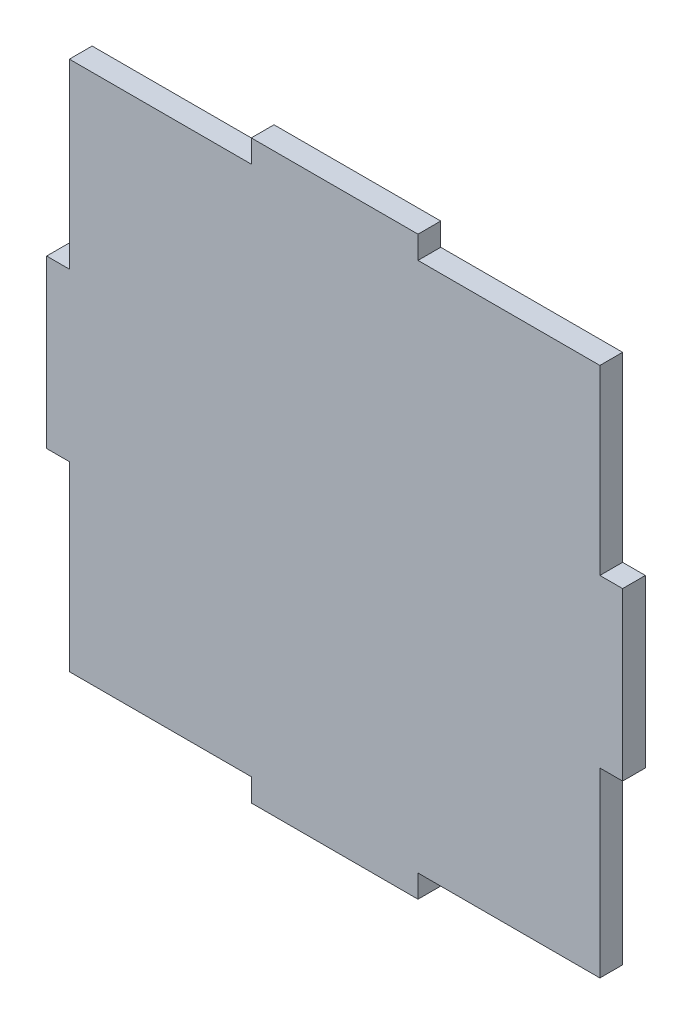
from build123d import *

# Parameters (mm, degrees)
BOSS_EXTRUDE1_DEPTH = 3


with BuildPart() as part:
    # Sketch1 → Boss-Extrude1 (new body)
    with BuildSketch(Plane.XY):
        Polygon((-24, 70), (0, 70), (0, 46), (3, 46), (3, 24), (0, 24), (0, 0), (-24, 0), (-24, -3), (-46, -3), (-46, 0), (-70, 0), (-70, 24), (-73, 24), (-73, 46), (-70, 46), (-70, 70), (-46, 70), (-46, 73), (-24, 73), align=None)
    extrude(amount=BOSS_EXTRUDE1_DEPTH)


solid = part.part
